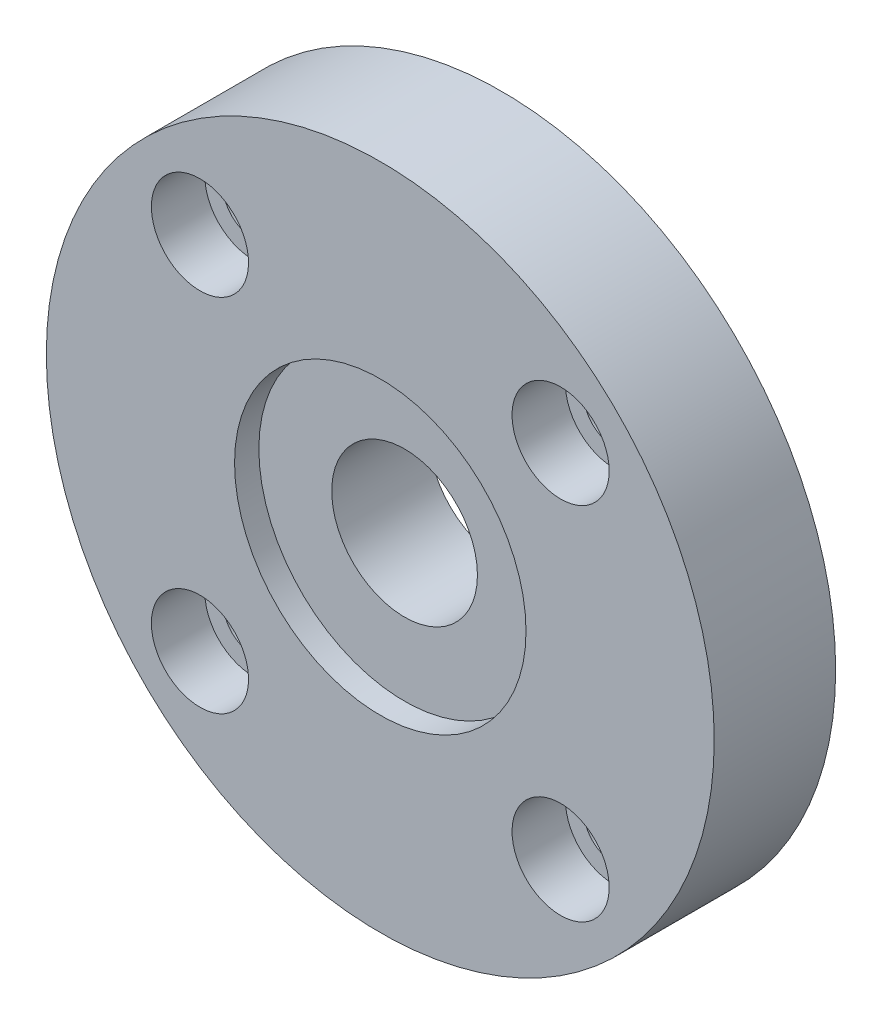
ISO-10303-21;
HEADER;
FILE_DESCRIPTION(('STEP AP214'),'2;1');
FILE_NAME('part.step','',(''),(''),'','','');
FILE_SCHEMA(('AUTOMOTIVE_DESIGN { 1 0 10303 214 1 1 1 1 }'));
ENDSEC;
DATA;
#1=APPLICATION_CONTEXT('core data for automotive mechanical design processes');
#2=APPLICATION_PROTOCOL_DEFINITION('international standard','automotive_design',2000,#1);
#3=PRODUCT_CONTEXT('',#1,'mechanical');
#4=PRODUCT('Part','Part','',(#3));
#5=PRODUCT_RELATED_PRODUCT_CATEGORY('part','',(#4));
#6=PRODUCT_DEFINITION_FORMATION('','',#4);
#7=PRODUCT_DEFINITION_CONTEXT('part definition',#1,'design');
#8=PRODUCT_DEFINITION('design','',#6,#7);
#9=PRODUCT_DEFINITION_SHAPE('','',#8);
#10=(LENGTH_UNIT() NAMED_UNIT(*) SI_UNIT(.MILLI.,.METRE.));
#11=(NAMED_UNIT(*) PLANE_ANGLE_UNIT() SI_UNIT($,.RADIAN.));
#12=(NAMED_UNIT(*) SI_UNIT($,.STERADIAN.) SOLID_ANGLE_UNIT());
#13=UNCERTAINTY_MEASURE_WITH_UNIT(LENGTH_MEASURE(1.E-05),#10,'distance_accuracy_value','');
#14=(GEOMETRIC_REPRESENTATION_CONTEXT(3) GLOBAL_UNCERTAINTY_ASSIGNED_CONTEXT((#13)) GLOBAL_UNIT_ASSIGNED_CONTEXT((#10,
#11,#12)) REPRESENTATION_CONTEXT('',''));
#15=CARTESIAN_POINT('',(0.,0.,0.));
#16=DIRECTION('',(0.,0.,1.));
#17=DIRECTION('',(1.,0.,0.));
#18=AXIS2_PLACEMENT_3D('',#15,#16,#17);
#19=CARTESIAN_POINT('',(0.,0.,10.));
#20=DIRECTION('',(0.,0.,-1.));
#21=DIRECTION('',(-1.,0.,0.));
#22=AXIS2_PLACEMENT_3D('',#19,#20,#21);
#23=CYLINDRICAL_SURFACE('',#22,6.);
#24=CARTESIAN_POINT('',(0.,0.,0.));
#25=DIRECTION('',(0.,0.,1.));
#26=DIRECTION('',(1.,0.,0.));
#27=AXIS2_PLACEMENT_3D('',#24,#25,#26);
#28=CIRCLE('',#27,6.);
#29=CARTESIAN_POINT('',(6.,0.,0.));
#30=VERTEX_POINT('',#29);
#31=EDGE_CURVE('E25',#30,#30,#28,.T.);
#32=ORIENTED_EDGE('',*,*,#31,.F.);
#33=EDGE_LOOP('',(#32));
#34=FACE_BOUND('',#33,.T.);
#35=CARTESIAN_POINT('',(0.,0.,8.));
#36=DIRECTION('',(0.,0.,1.));
#37=DIRECTION('',(1.,0.,0.));
#38=AXIS2_PLACEMENT_3D('',#35,#36,#37);
#39=CIRCLE('',#38,6.);
#40=CARTESIAN_POINT('',(6.,0.,8.));
#41=VERTEX_POINT('',#40);
#42=EDGE_CURVE('E16',#41,#41,#39,.T.);
#43=ORIENTED_EDGE('',*,*,#42,.T.);
#44=EDGE_LOOP('',(#43));
#45=FACE_BOUND('',#44,.T.);
#46=ADVANCED_FACE('F12',(#34,#45),#23,.F.);
#47=CARTESIAN_POINT('',(-14.8492424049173,14.8492424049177,0.));
#48=DIRECTION('',(0.,0.,1.));
#49=DIRECTION('',(1.,0.,0.));
#50=AXIS2_PLACEMENT_3D('',#47,#48,#49);
#51=CYLINDRICAL_SURFACE('',#50,2.5);
#52=CARTESIAN_POINT('',(-14.8492424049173,14.8492424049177,0.));
#53=DIRECTION('',(0.,0.,1.));
#54=DIRECTION('',(0.,1.,0.));
#55=AXIS2_PLACEMENT_3D('',#52,#53,#54);
#56=CIRCLE('',#55,2.5);
#57=CARTESIAN_POINT('',(-14.8492424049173,17.3492424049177,0.));
#58=VERTEX_POINT('',#57);
#59=EDGE_CURVE('E37',#58,#58,#56,.T.);
#60=ORIENTED_EDGE('',*,*,#59,.F.);
#61=EDGE_LOOP('',(#60));
#62=FACE_BOUND('',#61,.T.);
#63=CARTESIAN_POINT('',(-14.8492424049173,14.8492424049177,5.6));
#64=DIRECTION('',(0.,0.,1.));
#65=DIRECTION('',(1.,0.,0.));
#66=AXIS2_PLACEMENT_3D('',#63,#64,#65);
#67=CIRCLE('',#66,2.5);
#68=CARTESIAN_POINT('',(-12.3492424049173,14.8492424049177,5.6));
#69=VERTEX_POINT('',#68);
#70=EDGE_CURVE('E43',#69,#69,#67,.F.);
#71=ORIENTED_EDGE('',*,*,#70,.F.);
#72=EDGE_LOOP('',(#71));
#73=FACE_BOUND('',#72,.T.);
#74=ADVANCED_FACE('F87',(#62,#73),#51,.F.);
#75=CARTESIAN_POINT('',(-14.8492424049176,-14.8492424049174,0.));
#76=DIRECTION('',(0.,0.,1.));
#77=DIRECTION('',(1.,0.,0.));
#78=AXIS2_PLACEMENT_3D('',#75,#76,#77);
#79=CYLINDRICAL_SURFACE('',#78,2.5);
#80=CARTESIAN_POINT('',(-14.8492424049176,-14.8492424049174,0.));
#81=DIRECTION('',(0.,0.,1.));
#82=DIRECTION('',(-1.,0.,0.));
#83=AXIS2_PLACEMENT_3D('',#80,#81,#82);
#84=CIRCLE('',#83,2.5);
#85=CARTESIAN_POINT('',(-17.3492424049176,-14.8492424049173,0.));
#86=VERTEX_POINT('',#85);
#87=EDGE_CURVE('E68',#86,#86,#84,.T.);
#88=ORIENTED_EDGE('',*,*,#87,.F.);
#89=EDGE_LOOP('',(#88));
#90=FACE_BOUND('',#89,.T.);
#91=CARTESIAN_POINT('',(-14.8492424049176,-14.8492424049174,5.6));
#92=DIRECTION('',(0.,0.,1.));
#93=DIRECTION('',(1.,0.,0.));
#94=AXIS2_PLACEMENT_3D('',#91,#92,#93);
#95=CIRCLE('',#94,2.5);
#96=CARTESIAN_POINT('',(-12.3492424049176,-14.8492424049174,5.6));
#97=VERTEX_POINT('',#96);
#98=EDGE_CURVE('E39',#97,#97,#95,.F.);
#99=ORIENTED_EDGE('',*,*,#98,.F.);
#100=EDGE_LOOP('',(#99));
#101=FACE_BOUND('',#100,.T.);
#102=ADVANCED_FACE('F160',(#90,#101),#79,.F.);
#103=CARTESIAN_POINT('',(14.8492424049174,-14.8492424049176,0.));
#104=DIRECTION('',(0.,0.,1.));
#105=DIRECTION('',(1.,0.,0.));
#106=AXIS2_PLACEMENT_3D('',#103,#104,#105);
#107=CYLINDRICAL_SURFACE('',#106,2.5);
#108=CARTESIAN_POINT('',(14.8492424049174,-14.8492424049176,0.));
#109=DIRECTION('',(0.,0.,1.));
#110=DIRECTION('',(0.,-1.,0.));
#111=AXIS2_PLACEMENT_3D('',#108,#109,#110);
#112=CIRCLE('',#111,2.5);
#113=CARTESIAN_POINT('',(14.8492424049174,-17.3492424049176,0.));
#114=VERTEX_POINT('',#113);
#115=EDGE_CURVE('E71',#114,#114,#112,.T.);
#116=ORIENTED_EDGE('',*,*,#115,.F.);
#117=EDGE_LOOP('',(#116));
#118=FACE_BOUND('',#117,.T.);
#119=CARTESIAN_POINT('',(14.8492424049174,-14.8492424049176,5.6));
#120=DIRECTION('',(0.,0.,1.));
#121=DIRECTION('',(1.,0.,0.));
#122=AXIS2_PLACEMENT_3D('',#119,#120,#121);
#123=CIRCLE('',#122,2.5);
#124=CARTESIAN_POINT('',(17.3492424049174,-14.8492424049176,5.6));
#125=VERTEX_POINT('',#124);
#126=EDGE_CURVE('E34',#125,#125,#123,.F.);
#127=ORIENTED_EDGE('',*,*,#126,.F.);
#128=EDGE_LOOP('',(#127));
#129=FACE_BOUND('',#128,.T.);
#130=ADVANCED_FACE('F135',(#118,#129),#107,.F.);
#131=CARTESIAN_POINT('',(14.8492424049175,14.8492424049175,0.));
#132=DIRECTION('',(0.,0.,1.));
#133=DIRECTION('',(1.,0.,0.));
#134=AXIS2_PLACEMENT_3D('',#131,#132,#133);
#135=CYLINDRICAL_SURFACE('',#134,2.5);
#136=CARTESIAN_POINT('',(14.8492424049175,14.8492424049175,0.));
#137=DIRECTION('',(0.,0.,1.));
#138=DIRECTION('',(1.,0.,0.));
#139=AXIS2_PLACEMENT_3D('',#136,#137,#138);
#140=CIRCLE('',#139,2.5);
#141=CARTESIAN_POINT('',(17.3492424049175,14.8492424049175,0.));
#142=VERTEX_POINT('',#141);
#143=EDGE_CURVE('E32',#142,#142,#140,.T.);
#144=ORIENTED_EDGE('',*,*,#143,.F.);
#145=EDGE_LOOP('',(#144));
#146=FACE_BOUND('',#145,.T.);
#147=CARTESIAN_POINT('',(14.8492424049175,14.8492424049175,5.6));
#148=DIRECTION('',(0.,0.,1.));
#149=DIRECTION('',(1.,0.,0.));
#150=AXIS2_PLACEMENT_3D('',#147,#148,#149);
#151=CIRCLE('',#150,2.5);
#152=CARTESIAN_POINT('',(17.3492424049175,14.8492424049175,5.6));
#153=VERTEX_POINT('',#152);
#154=EDGE_CURVE('E29',#153,#153,#151,.F.);
#155=ORIENTED_EDGE('',*,*,#154,.F.);
#156=EDGE_LOOP('',(#155));
#157=FACE_BOUND('',#156,.T.);
#158=ADVANCED_FACE('F106',(#146,#157),#135,.F.);
#159=CARTESIAN_POINT('',(0.,0.,10.));
#160=DIRECTION('',(0.,0.,1.));
#161=DIRECTION('',(1.,0.,0.));
#162=AXIS2_PLACEMENT_3D('',#159,#160,#161);
#163=PLANE('',#162);
#164=CARTESIAN_POINT('',(0.,0.,10.));
#165=DIRECTION('',(0.,0.,1.));
#166=DIRECTION('',(1.,0.,0.));
#167=AXIS2_PLACEMENT_3D('',#164,#165,#166);
#168=CIRCLE('',#167,12.);
#169=CARTESIAN_POINT('',(12.,0.,10.));
#170=VERTEX_POINT('',#169);
#171=EDGE_CURVE('E94',#170,#170,#168,.T.);
#172=ORIENTED_EDGE('',*,*,#171,.F.);
#173=EDGE_LOOP('',(#172));
#174=FACE_BOUND('',#173,.T.);
#175=CARTESIAN_POINT('',(-14.8492424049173,14.8492424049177,10.));
#176=DIRECTION('',(0.,0.,1.));
#177=DIRECTION('',(0.,1.,0.));
#178=AXIS2_PLACEMENT_3D('',#175,#176,#177);
#179=CIRCLE('',#178,4.);
#180=CARTESIAN_POINT('',(-14.8492424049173,18.8492424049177,10.));
#181=VERTEX_POINT('',#180);
#182=EDGE_CURVE('E52',#181,#181,#179,.T.);
#183=ORIENTED_EDGE('',*,*,#182,.F.);
#184=EDGE_LOOP('',(#183));
#185=FACE_BOUND('',#184,.T.);
#186=CARTESIAN_POINT('',(-14.8492424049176,-14.8492424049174,10.));
#187=DIRECTION('',(0.,0.,1.));
#188=DIRECTION('',(-1.,0.,0.));
#189=AXIS2_PLACEMENT_3D('',#186,#187,#188);
#190=CIRCLE('',#189,4.);
#191=CARTESIAN_POINT('',(-18.8492424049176,-14.8492424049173,10.));
#192=VERTEX_POINT('',#191);
#193=EDGE_CURVE('E45',#192,#192,#190,.T.);
#194=ORIENTED_EDGE('',*,*,#193,.F.);
#195=EDGE_LOOP('',(#194));
#196=FACE_BOUND('',#195,.T.);
#197=CARTESIAN_POINT('',(14.8492424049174,-14.8492424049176,10.));
#198=DIRECTION('',(0.,0.,1.));
#199=DIRECTION('',(0.,-1.,0.));
#200=AXIS2_PLACEMENT_3D('',#197,#198,#199);
#201=CIRCLE('',#200,4.);
#202=CARTESIAN_POINT('',(14.8492424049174,-18.8492424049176,10.));
#203=VERTEX_POINT('',#202);
#204=EDGE_CURVE('E41',#203,#203,#201,.T.);
#205=ORIENTED_EDGE('',*,*,#204,.F.);
#206=EDGE_LOOP('',(#205));
#207=FACE_BOUND('',#206,.T.);
#208=CARTESIAN_POINT('',(14.8492424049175,14.8492424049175,10.));
#209=DIRECTION('',(0.,0.,1.));
#210=DIRECTION('',(1.,0.,0.));
#211=AXIS2_PLACEMENT_3D('',#208,#209,#210);
#212=CIRCLE('',#211,4.);
#213=CARTESIAN_POINT('',(18.8492424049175,14.8492424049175,10.));
#214=VERTEX_POINT('',#213);
#215=EDGE_CURVE('E74',#214,#214,#212,.T.);
#216=ORIENTED_EDGE('',*,*,#215,.F.);
#217=EDGE_LOOP('',(#216));
#218=FACE_BOUND('',#217,.T.);
#219=CARTESIAN_POINT('',(0.,0.,10.));
#220=DIRECTION('',(0.,0.,1.));
#221=DIRECTION('',(1.,0.,0.));
#222=AXIS2_PLACEMENT_3D('',#219,#220,#221);
#223=CIRCLE('',#222,27.5);
#224=CARTESIAN_POINT('',(27.5,0.,10.));
#225=VERTEX_POINT('',#224);
#226=EDGE_CURVE('E8',#225,#225,#223,.T.);
#227=ORIENTED_EDGE('',*,*,#226,.T.);
#228=EDGE_LOOP('',(#227));
#229=FACE_BOUND('',#228,.T.);
#230=ADVANCED_FACE('F103',(#174,#185,#196,#207,#218,#229),#163,.T.);
#231=CARTESIAN_POINT('',(0.,0.,0.));
#232=DIRECTION('',(0.,0.,1.));
#233=DIRECTION('',(1.,0.,0.));
#234=AXIS2_PLACEMENT_3D('',#231,#232,#233);
#235=PLANE('',#234);
#236=ORIENTED_EDGE('',*,*,#59,.T.);
#237=EDGE_LOOP('',(#236));
#238=FACE_BOUND('',#237,.T.);
#239=ORIENTED_EDGE('',*,*,#87,.T.);
#240=EDGE_LOOP('',(#239));
#241=FACE_BOUND('',#240,.T.);
#242=ORIENTED_EDGE('',*,*,#115,.T.);
#243=EDGE_LOOP('',(#242));
#244=FACE_BOUND('',#243,.T.);
#245=ORIENTED_EDGE('',*,*,#143,.T.);
#246=EDGE_LOOP('',(#245));
#247=FACE_BOUND('',#246,.T.);
#248=CARTESIAN_POINT('',(0.,0.,0.));
#249=DIRECTION('',(0.,0.,1.));
#250=DIRECTION('',(1.,0.,0.));
#251=AXIS2_PLACEMENT_3D('',#248,#249,#250);
#252=CIRCLE('',#251,27.5);
#253=CARTESIAN_POINT('',(27.5,0.,0.));
#254=VERTEX_POINT('',#253);
#255=EDGE_CURVE('E20',#254,#254,#252,.T.);
#256=ORIENTED_EDGE('',*,*,#255,.F.);
#257=EDGE_LOOP('',(#256));
#258=FACE_BOUND('',#257,.T.);
#259=ORIENTED_EDGE('',*,*,#31,.T.);
#260=EDGE_LOOP('',(#259));
#261=FACE_BOUND('',#260,.T.);
#262=ADVANCED_FACE('F83',(#238,#241,#244,#247,#258,#261),#235,.F.);
#263=CARTESIAN_POINT('',(0.,0.,10.));
#264=DIRECTION('',(0.,0.,-1.));
#265=DIRECTION('',(-1.,0.,0.));
#266=AXIS2_PLACEMENT_3D('',#263,#264,#265);
#267=CYLINDRICAL_SURFACE('',#266,27.5);
#268=ORIENTED_EDGE('',*,*,#226,.F.);
#269=EDGE_LOOP('',(#268));
#270=FACE_BOUND('',#269,.T.);
#271=ORIENTED_EDGE('',*,*,#255,.T.);
#272=EDGE_LOOP('',(#271));
#273=FACE_BOUND('',#272,.T.);
#274=ADVANCED_FACE('F14',(#270,#273),#267,.T.);
#275=CARTESIAN_POINT('',(14.8492424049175,14.8492424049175,5.6));
#276=DIRECTION('',(0.,0.,1.));
#277=DIRECTION('',(1.,0.,0.));
#278=AXIS2_PLACEMENT_3D('',#275,#276,#277);
#279=PLANE('',#278);
#280=CARTESIAN_POINT('',(14.8492424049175,14.8492424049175,5.6));
#281=DIRECTION('',(0.,0.,1.));
#282=DIRECTION('',(1.,0.,0.));
#283=AXIS2_PLACEMENT_3D('',#280,#281,#282);
#284=CIRCLE('',#283,4.);
#285=CARTESIAN_POINT('',(18.8492424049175,14.8492424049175,5.6));
#286=VERTEX_POINT('',#285);
#287=EDGE_CURVE('E33',#286,#286,#284,.T.);
#288=ORIENTED_EDGE('',*,*,#287,.T.);
#289=EDGE_LOOP('',(#288));
#290=FACE_BOUND('',#289,.T.);
#291=ORIENTED_EDGE('',*,*,#154,.T.);
#292=EDGE_LOOP('',(#291));
#293=FACE_BOUND('',#292,.T.);
#294=ADVANCED_FACE('F118',(#290,#293),#279,.T.);
#295=CARTESIAN_POINT('',(14.8492424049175,14.8492424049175,5.6));
#296=DIRECTION('',(0.,0.,1.));
#297=DIRECTION('',(1.,0.,0.));
#298=AXIS2_PLACEMENT_3D('',#295,#296,#297);
#299=CYLINDRICAL_SURFACE('',#298,4.);
#300=ORIENTED_EDGE('',*,*,#287,.F.);
#301=EDGE_LOOP('',(#300));
#302=FACE_BOUND('',#301,.T.);
#303=ORIENTED_EDGE('',*,*,#215,.T.);
#304=EDGE_LOOP('',(#303));
#305=FACE_BOUND('',#304,.T.);
#306=ADVANCED_FACE('F115',(#302,#305),#299,.F.);
#307=CARTESIAN_POINT('',(14.8492424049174,-14.8492424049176,5.6));
#308=DIRECTION('',(0.,0.,1.));
#309=DIRECTION('',(0.,-1.,0.));
#310=AXIS2_PLACEMENT_3D('',#307,#308,#309);
#311=PLANE('',#310);
#312=CARTESIAN_POINT('',(14.8492424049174,-14.8492424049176,5.6));
#313=DIRECTION('',(0.,0.,1.));
#314=DIRECTION('',(0.,-1.,0.));
#315=AXIS2_PLACEMENT_3D('',#312,#313,#314);
#316=CIRCLE('',#315,4.);
#317=CARTESIAN_POINT('',(14.8492424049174,-18.8492424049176,5.6));
#318=VERTEX_POINT('',#317);
#319=EDGE_CURVE('E38',#318,#318,#316,.T.);
#320=ORIENTED_EDGE('',*,*,#319,.T.);
#321=EDGE_LOOP('',(#320));
#322=FACE_BOUND('',#321,.T.);
#323=ORIENTED_EDGE('',*,*,#126,.T.);
#324=EDGE_LOOP('',(#323));
#325=FACE_BOUND('',#324,.T.);
#326=ADVANCED_FACE('F117',(#322,#325),#311,.T.);
#327=CARTESIAN_POINT('',(14.8492424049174,-14.8492424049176,5.6));
#328=DIRECTION('',(0.,0.,1.));
#329=DIRECTION('',(1.,0.,0.));
#330=AXIS2_PLACEMENT_3D('',#327,#328,#329);
#331=CYLINDRICAL_SURFACE('',#330,4.);
#332=ORIENTED_EDGE('',*,*,#319,.F.);
#333=EDGE_LOOP('',(#332));
#334=FACE_BOUND('',#333,.T.);
#335=ORIENTED_EDGE('',*,*,#204,.T.);
#336=EDGE_LOOP('',(#335));
#337=FACE_BOUND('',#336,.T.);
#338=ADVANCED_FACE('F126',(#334,#337),#331,.F.);
#339=CARTESIAN_POINT('',(-14.8492424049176,-14.8492424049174,5.6));
#340=DIRECTION('',(0.,0.,1.));
#341=DIRECTION('',(-1.,0.,0.));
#342=AXIS2_PLACEMENT_3D('',#339,#340,#341);
#343=PLANE('',#342);
#344=CARTESIAN_POINT('',(-14.8492424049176,-14.8492424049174,5.6));
#345=DIRECTION('',(0.,0.,1.));
#346=DIRECTION('',(-1.,0.,0.));
#347=AXIS2_PLACEMENT_3D('',#344,#345,#346);
#348=CIRCLE('',#347,4.);
#349=CARTESIAN_POINT('',(-18.8492424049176,-14.8492424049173,5.6));
#350=VERTEX_POINT('',#349);
#351=EDGE_CURVE('E42',#350,#350,#348,.T.);
#352=ORIENTED_EDGE('',*,*,#351,.T.);
#353=EDGE_LOOP('',(#352));
#354=FACE_BOUND('',#353,.T.);
#355=ORIENTED_EDGE('',*,*,#98,.T.);
#356=EDGE_LOOP('',(#355));
#357=FACE_BOUND('',#356,.T.);
#358=ADVANCED_FACE('F173',(#354,#357),#343,.T.);
#359=CARTESIAN_POINT('',(-14.8492424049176,-14.8492424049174,5.6));
#360=DIRECTION('',(0.,0.,1.));
#361=DIRECTION('',(1.,0.,0.));
#362=AXIS2_PLACEMENT_3D('',#359,#360,#361);
#363=CYLINDRICAL_SURFACE('',#362,4.);
#364=ORIENTED_EDGE('',*,*,#351,.F.);
#365=EDGE_LOOP('',(#364));
#366=FACE_BOUND('',#365,.T.);
#367=ORIENTED_EDGE('',*,*,#193,.T.);
#368=EDGE_LOOP('',(#367));
#369=FACE_BOUND('',#368,.T.);
#370=ADVANCED_FACE('F176',(#366,#369),#363,.F.);
#371=CARTESIAN_POINT('',(-14.8492424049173,14.8492424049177,5.6));
#372=DIRECTION('',(0.,0.,1.));
#373=DIRECTION('',(0.,1.,0.));
#374=AXIS2_PLACEMENT_3D('',#371,#372,#373);
#375=PLANE('',#374);
#376=CARTESIAN_POINT('',(-14.8492424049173,14.8492424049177,5.6));
#377=DIRECTION('',(0.,0.,1.));
#378=DIRECTION('',(0.,1.,0.));
#379=AXIS2_PLACEMENT_3D('',#376,#377,#378);
#380=CIRCLE('',#379,4.);
#381=CARTESIAN_POINT('',(-14.8492424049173,18.8492424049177,5.6));
#382=VERTEX_POINT('',#381);
#383=EDGE_CURVE('E46',#382,#382,#380,.T.);
#384=ORIENTED_EDGE('',*,*,#383,.T.);
#385=EDGE_LOOP('',(#384));
#386=FACE_BOUND('',#385,.T.);
#387=ORIENTED_EDGE('',*,*,#70,.T.);
#388=EDGE_LOOP('',(#387));
#389=FACE_BOUND('',#388,.T.);
#390=ADVANCED_FACE('F179',(#386,#389),#375,.T.);
#391=CARTESIAN_POINT('',(-14.8492424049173,14.8492424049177,5.6));
#392=DIRECTION('',(0.,0.,1.));
#393=DIRECTION('',(1.,0.,0.));
#394=AXIS2_PLACEMENT_3D('',#391,#392,#393);
#395=CYLINDRICAL_SURFACE('',#394,4.);
#396=ORIENTED_EDGE('',*,*,#383,.F.);
#397=EDGE_LOOP('',(#396));
#398=FACE_BOUND('',#397,.T.);
#399=ORIENTED_EDGE('',*,*,#182,.T.);
#400=EDGE_LOOP('',(#399));
#401=FACE_BOUND('',#400,.T.);
#402=ADVANCED_FACE('F184',(#398,#401),#395,.F.);
#403=CARTESIAN_POINT('',(0.,0.,8.));
#404=DIRECTION('',(0.,0.,1.));
#405=DIRECTION('',(1.,0.,0.));
#406=AXIS2_PLACEMENT_3D('',#403,#404,#405);
#407=CYLINDRICAL_SURFACE('',#406,12.);
#408=CARTESIAN_POINT('',(0.,0.,8.));
#409=DIRECTION('',(0.,0.,1.));
#410=DIRECTION('',(1.,0.,0.));
#411=AXIS2_PLACEMENT_3D('',#408,#409,#410);
#412=CIRCLE('',#411,12.);
#413=CARTESIAN_POINT('',(12.,0.,8.));
#414=VERTEX_POINT('',#413);
#415=EDGE_CURVE('E92',#414,#414,#412,.T.);
#416=ORIENTED_EDGE('',*,*,#415,.F.);
#417=EDGE_LOOP('',(#416));
#418=FACE_BOUND('',#417,.T.);
#419=ORIENTED_EDGE('',*,*,#171,.T.);
#420=EDGE_LOOP('',(#419));
#421=FACE_BOUND('',#420,.T.);
#422=ADVANCED_FACE('F101',(#418,#421),#407,.F.);
#423=CARTESIAN_POINT('',(0.,0.,8.));
#424=DIRECTION('',(0.,0.,1.));
#425=DIRECTION('',(1.,0.,0.));
#426=AXIS2_PLACEMENT_3D('',#423,#424,#425);
#427=PLANE('',#426);
#428=ORIENTED_EDGE('',*,*,#42,.F.);
#429=EDGE_LOOP('',(#428));
#430=FACE_BOUND('',#429,.T.);
#431=ORIENTED_EDGE('',*,*,#415,.T.);
#432=EDGE_LOOP('',(#431));
#433=FACE_BOUND('',#432,.T.);
#434=ADVANCED_FACE('F188',(#430,#433),#427,.T.);
#435=CLOSED_SHELL('',(#46,#74,#102,#130,#158,#230,#262,#274,#294,#306,#326,#338,#358,#370,#390,
#402,#422,#434));
#436=MANIFOLD_SOLID_BREP('B1',#435);
#437=ADVANCED_BREP_SHAPE_REPRESENTATION('',(#18,#436),#14);
#438=SHAPE_DEFINITION_REPRESENTATION(#9,#437);
ENDSEC;
END-ISO-10303-21;
